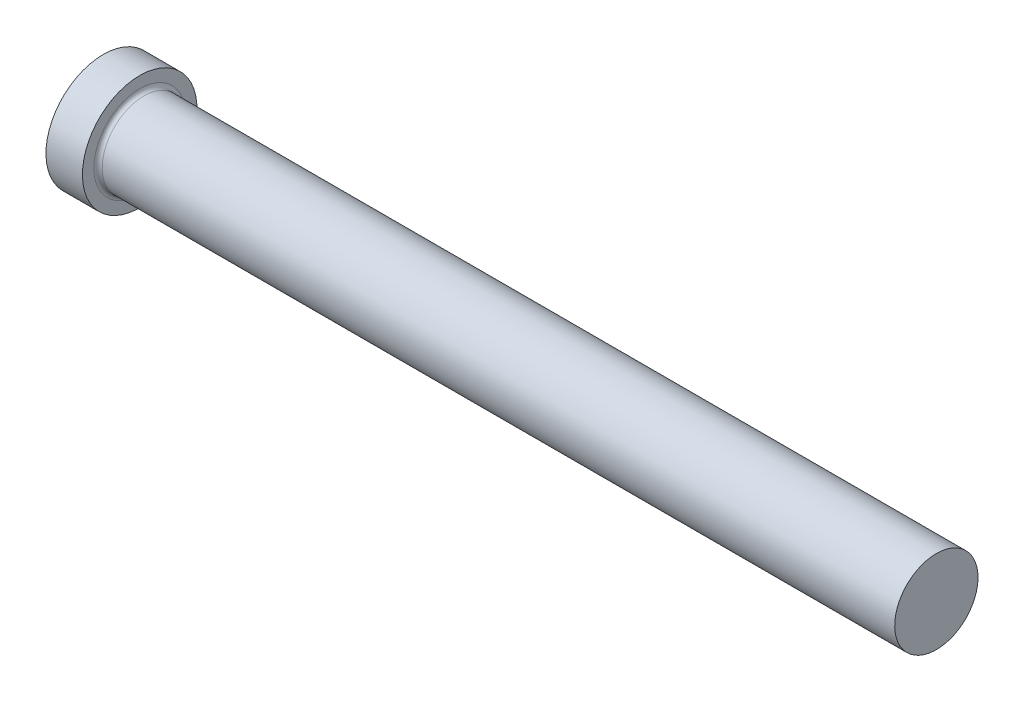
ISO-10303-21;
HEADER;
FILE_DESCRIPTION(('STEP AP214'),'2;1');
FILE_NAME('part.step','',(''),(''),'','','');
FILE_SCHEMA(('AUTOMOTIVE_DESIGN { 1 0 10303 214 1 1 1 1 }'));
ENDSEC;
DATA;
#1=APPLICATION_CONTEXT('core data for automotive mechanical design processes');
#2=APPLICATION_PROTOCOL_DEFINITION('international standard','automotive_design',2000,#1);
#3=PRODUCT_CONTEXT('',#1,'mechanical');
#4=PRODUCT('Part','Part','',(#3));
#5=PRODUCT_RELATED_PRODUCT_CATEGORY('part','',(#4));
#6=PRODUCT_DEFINITION_FORMATION('','',#4);
#7=PRODUCT_DEFINITION_CONTEXT('part definition',#1,'design');
#8=PRODUCT_DEFINITION('design','',#6,#7);
#9=PRODUCT_DEFINITION_SHAPE('','',#8);
#10=(LENGTH_UNIT() NAMED_UNIT(*) SI_UNIT(.MILLI.,.METRE.));
#11=(NAMED_UNIT(*) PLANE_ANGLE_UNIT() SI_UNIT($,.RADIAN.));
#12=(NAMED_UNIT(*) SI_UNIT($,.STERADIAN.) SOLID_ANGLE_UNIT());
#13=UNCERTAINTY_MEASURE_WITH_UNIT(LENGTH_MEASURE(1.E-05),#10,'distance_accuracy_value','');
#14=(GEOMETRIC_REPRESENTATION_CONTEXT(3) GLOBAL_UNCERTAINTY_ASSIGNED_CONTEXT((#13)) GLOBAL_UNIT_ASSIGNED_CONTEXT((#10,
#11,#12)) REPRESENTATION_CONTEXT('',''));
#15=CARTESIAN_POINT('',(0.,0.,0.));
#16=DIRECTION('',(0.,0.,1.));
#17=DIRECTION('',(1.,0.,0.));
#18=AXIS2_PLACEMENT_3D('',#15,#16,#17);
#19=CARTESIAN_POINT('',(0.,0.,0.));
#20=DIRECTION('',(-1.,0.,0.));
#21=DIRECTION('',(0.,-1.,0.));
#22=AXIS2_PLACEMENT_3D('',#19,#20,#21);
#23=PLANE('',#22);
#24=CARTESIAN_POINT('',(0.,0.,0.));
#25=DIRECTION('',(1.,0.,0.));
#26=DIRECTION('',(0.,1.,0.));
#27=AXIS2_PLACEMENT_3D('',#24,#25,#26);
#28=CIRCLE('',#27,11.);
#29=CARTESIAN_POINT('',(0.,11.,0.));
#30=VERTEX_POINT('',#29);
#31=EDGE_CURVE('E25',#30,#30,#28,.T.);
#32=ORIENTED_EDGE('',*,*,#31,.F.);
#33=EDGE_LOOP('',(#32));
#34=FACE_BOUND('',#33,.T.);
#35=ADVANCED_FACE('F14',(#34),#23,.T.);
#36=CARTESIAN_POINT('',(160.,0.,0.));
#37=DIRECTION('',(1.,0.,0.));
#38=DIRECTION('',(0.,1.,0.));
#39=AXIS2_PLACEMENT_3D('',#36,#37,#38);
#40=CYLINDRICAL_SURFACE('',#39,11.);
#41=ORIENTED_EDGE('',*,*,#31,.T.);
#42=EDGE_LOOP('',(#41));
#43=FACE_BOUND('',#42,.T.);
#44=CARTESIAN_POINT('',(7.,0.,0.));
#45=DIRECTION('',(1.,0.,0.));
#46=DIRECTION('',(0.,1.,0.));
#47=AXIS2_PLACEMENT_3D('',#44,#45,#46);
#48=CIRCLE('',#47,11.);
#49=CARTESIAN_POINT('',(7.,11.,0.));
#50=VERTEX_POINT('',#49);
#51=EDGE_CURVE('E29',#50,#50,#48,.T.);
#52=ORIENTED_EDGE('',*,*,#51,.F.);
#53=EDGE_LOOP('',(#52));
#54=FACE_BOUND('',#53,.T.);
#55=ADVANCED_FACE('F51',(#43,#54),#40,.T.);
#56=CARTESIAN_POINT('',(7.,11.,0.));
#57=DIRECTION('',(1.,0.,0.));
#58=DIRECTION('',(0.,1.,0.));
#59=AXIS2_PLACEMENT_3D('',#56,#57,#58);
#60=PLANE('',#59);
#61=CARTESIAN_POINT('',(7.,0.,0.));
#62=DIRECTION('',(1.,0.,0.));
#63=DIRECTION('',(0.,1.,0.));
#64=AXIS2_PLACEMENT_3D('',#61,#62,#63);
#65=CIRCLE('',#64,8.8);
#66=CARTESIAN_POINT('',(7.,8.8,0.));
#67=VERTEX_POINT('',#66);
#68=EDGE_CURVE('E9',#67,#67,#65,.F.);
#69=ORIENTED_EDGE('',*,*,#68,.T.);
#70=EDGE_LOOP('',(#69));
#71=FACE_BOUND('',#70,.T.);
#72=ORIENTED_EDGE('',*,*,#51,.T.);
#73=EDGE_LOOP('',(#72));
#74=FACE_BOUND('',#73,.T.);
#75=ADVANCED_FACE('F42',(#71,#74),#60,.T.);
#76=CARTESIAN_POINT('',(160.,0.,0.));
#77=DIRECTION('',(1.,0.,0.));
#78=DIRECTION('',(0.,1.,0.));
#79=AXIS2_PLACEMENT_3D('',#76,#77,#78);
#80=CYLINDRICAL_SURFACE('',#79,8.);
#81=CARTESIAN_POINT('',(7.8,0.,0.));
#82=DIRECTION('',(1.,0.,0.));
#83=DIRECTION('',(0.,1.,0.));
#84=AXIS2_PLACEMENT_3D('',#81,#82,#83);
#85=CIRCLE('',#84,8.);
#86=CARTESIAN_POINT('',(7.8,8.,0.));
#87=VERTEX_POINT('',#86);
#88=EDGE_CURVE('E21',#87,#87,#85,.T.);
#89=ORIENTED_EDGE('',*,*,#88,.T.);
#90=EDGE_LOOP('',(#89));
#91=FACE_BOUND('',#90,.T.);
#92=CARTESIAN_POINT('',(160.,0.,0.));
#93=DIRECTION('',(1.,0.,0.));
#94=DIRECTION('',(0.,1.,0.));
#95=AXIS2_PLACEMENT_3D('',#92,#93,#94);
#96=CIRCLE('',#95,8.);
#97=CARTESIAN_POINT('',(160.,8.,0.));
#98=VERTEX_POINT('',#97);
#99=EDGE_CURVE('E34',#98,#98,#96,.T.);
#100=ORIENTED_EDGE('',*,*,#99,.F.);
#101=EDGE_LOOP('',(#100));
#102=FACE_BOUND('',#101,.T.);
#103=ADVANCED_FACE('F40',(#91,#102),#80,.T.);
#104=CARTESIAN_POINT('',(160.,8.,0.));
#105=DIRECTION('',(1.,0.,0.));
#106=DIRECTION('',(0.,1.,0.));
#107=AXIS2_PLACEMENT_3D('',#104,#105,#106);
#108=PLANE('',#107);
#109=ORIENTED_EDGE('',*,*,#99,.T.);
#110=EDGE_LOOP('',(#109));
#111=FACE_BOUND('',#110,.T.);
#112=ADVANCED_FACE('F38',(#111),#108,.T.);
#113=CARTESIAN_POINT('',(7.8,0.,0.));
#114=DIRECTION('',(1.,0.,0.));
#115=DIRECTION('',(0.,1.,0.));
#116=AXIS2_PLACEMENT_3D('',#113,#114,#115);
#117=TOROIDAL_SURFACE('',#116,8.8,0.8);
#118=ORIENTED_EDGE('',*,*,#68,.F.);
#119=EDGE_LOOP('',(#118));
#120=FACE_BOUND('',#119,.T.);
#121=ORIENTED_EDGE('',*,*,#88,.F.);
#122=EDGE_LOOP('',(#121));
#123=FACE_BOUND('',#122,.T.);
#124=ADVANCED_FACE('F16',(#120,#123),#117,.F.);
#125=CLOSED_SHELL('',(#35,#55,#75,#103,#112,#124));
#126=MANIFOLD_SOLID_BREP('B1',#125);
#127=ADVANCED_BREP_SHAPE_REPRESENTATION('',(#18,#126),#14);
#128=SHAPE_DEFINITION_REPRESENTATION(#9,#127);
ENDSEC;
END-ISO-10303-21;
